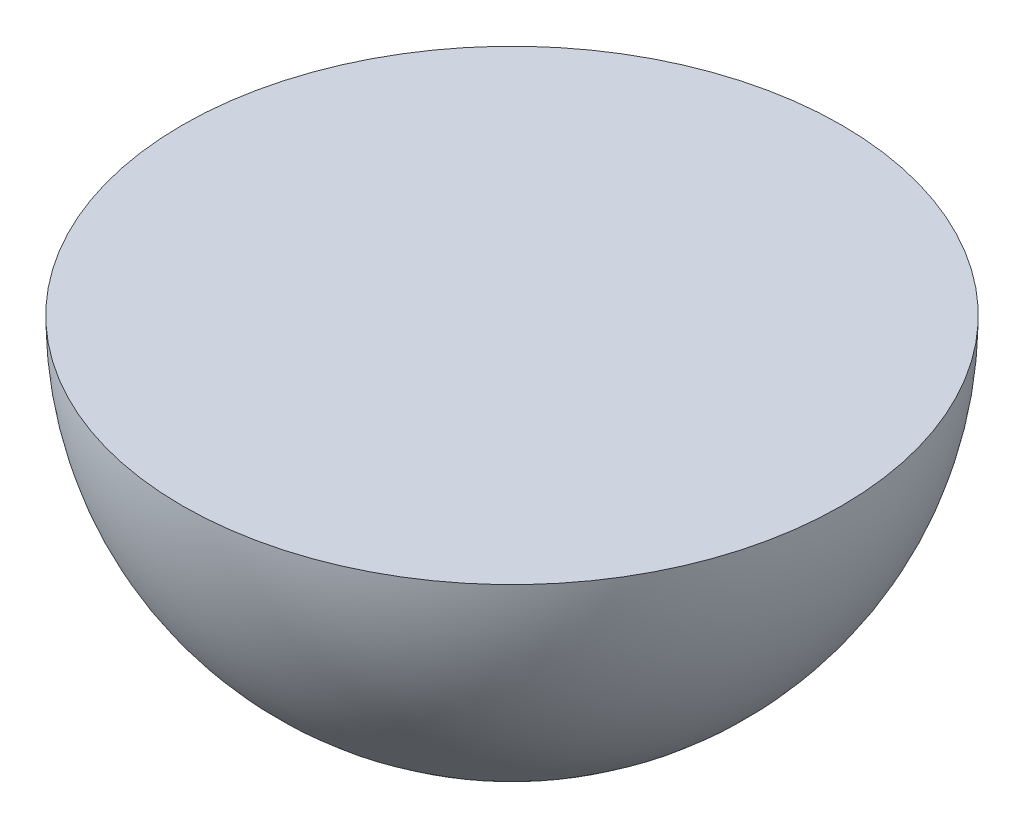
ISO-10303-21;
HEADER;
FILE_DESCRIPTION(('STEP AP214'),'2;1');
FILE_NAME('part.step','',(''),(''),'','','');
FILE_SCHEMA(('AUTOMOTIVE_DESIGN { 1 0 10303 214 1 1 1 1 }'));
ENDSEC;
DATA;
#1=APPLICATION_CONTEXT('core data for automotive mechanical design processes');
#2=APPLICATION_PROTOCOL_DEFINITION('international standard','automotive_design',2000,#1);
#3=PRODUCT_CONTEXT('',#1,'mechanical');
#4=PRODUCT('Part','Part','',(#3));
#5=PRODUCT_RELATED_PRODUCT_CATEGORY('part','',(#4));
#6=PRODUCT_DEFINITION_FORMATION('','',#4);
#7=PRODUCT_DEFINITION_CONTEXT('part definition',#1,'design');
#8=PRODUCT_DEFINITION('design','',#6,#7);
#9=PRODUCT_DEFINITION_SHAPE('','',#8);
#10=(LENGTH_UNIT() NAMED_UNIT(*) SI_UNIT(.MILLI.,.METRE.));
#11=(NAMED_UNIT(*) PLANE_ANGLE_UNIT() SI_UNIT($,.RADIAN.));
#12=(NAMED_UNIT(*) SI_UNIT($,.STERADIAN.) SOLID_ANGLE_UNIT());
#13=UNCERTAINTY_MEASURE_WITH_UNIT(LENGTH_MEASURE(1.E-05),#10,'distance_accuracy_value','');
#14=(GEOMETRIC_REPRESENTATION_CONTEXT(3) GLOBAL_UNCERTAINTY_ASSIGNED_CONTEXT((#13)) GLOBAL_UNIT_ASSIGNED_CONTEXT((#10,
#11,#12)) REPRESENTATION_CONTEXT('',''));
#15=CARTESIAN_POINT('',(0.,0.,0.));
#16=DIRECTION('',(0.,0.,1.));
#17=DIRECTION('',(1.,0.,0.));
#18=AXIS2_PLACEMENT_3D('',#15,#16,#17);
#19=CARTESIAN_POINT('',(-190.7,-6.65825491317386E-13,0.));
#20=DIRECTION('',(0.,-1.,0.));
#21=DIRECTION('',(0.,0.,-1.));
#22=AXIS2_PLACEMENT_3D('',#19,#20,#21);
#23=PLANE('',#22);
#24=CARTESIAN_POINT('',(0.,-1.33226762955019E-12,0.));
#25=DIRECTION('',(0.,-1.,0.));
#26=DIRECTION('',(0.,0.,-1.));
#27=AXIS2_PLACEMENT_3D('',#24,#25,#26);
#28=CIRCLE('',#27,190.7);
#29=CARTESIAN_POINT('',(0.,-1.33226762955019E-12,-190.7));
#30=VERTEX_POINT('',#29);
#31=EDGE_CURVE('E10',#30,#30,#28,.T.);
#32=ORIENTED_EDGE('',*,*,#31,.F.);
#33=EDGE_LOOP('',(#32));
#34=FACE_BOUND('',#33,.T.);
#35=ADVANCED_FACE('F31',(#34),#23,.F.);
#36=CARTESIAN_POINT('',(0.,0.,0.));
#37=DIRECTION('',(0.,-1.,0.));
#38=DIRECTION('',(-1.,0.,0.));
#39=AXIS2_PLACEMENT_3D('',#36,#37,#38);
#40=SPHERICAL_SURFACE('',#39,190.7);
#41=ORIENTED_EDGE('',*,*,#31,.T.);
#42=EDGE_LOOP('',(#41));
#43=FACE_BOUND('',#42,.T.);
#44=ADVANCED_FACE('F38',(#43),#40,.T.);
#45=CLOSED_SHELL('',(#35,#44));
#46=MANIFOLD_SOLID_BREP('B2',#45);
#47=ADVANCED_BREP_SHAPE_REPRESENTATION('',(#18,#46),#14);
#48=SHAPE_DEFINITION_REPRESENTATION(#9,#47);
ENDSEC;
END-ISO-10303-21;
